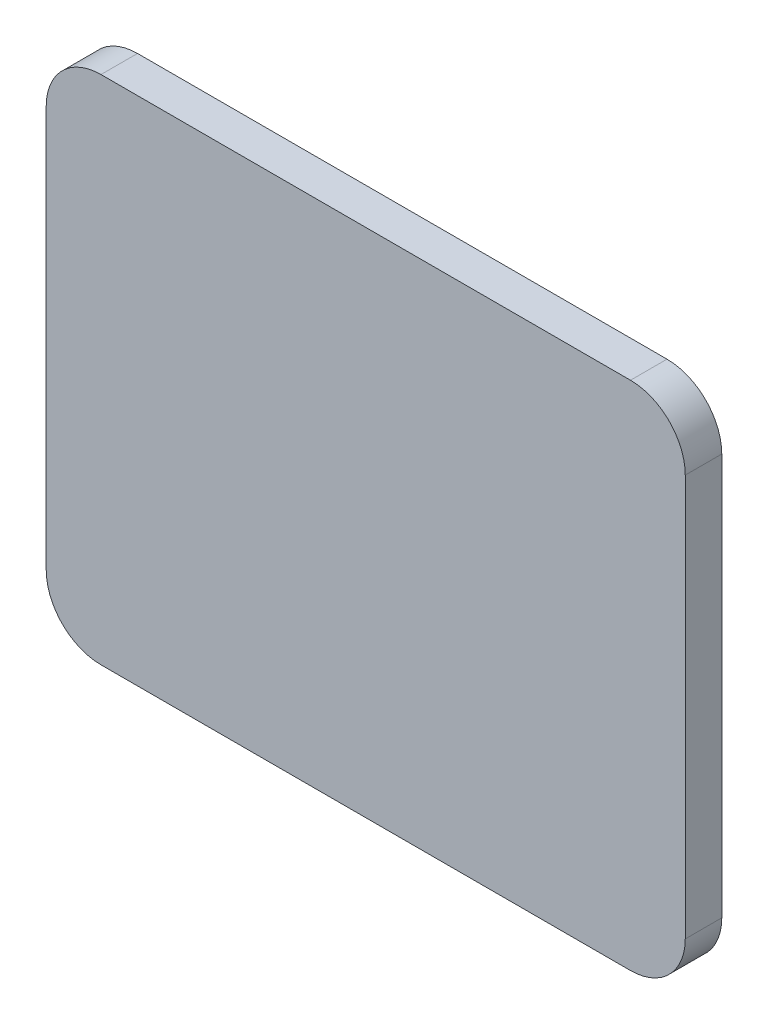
from build123d import *

# Parameters (mm, degrees)
EXTRUDE_1_DEPTH = 0.2


with BuildPart() as part:
    # Sketch 1 → Extrude 1 (new body)
    with BuildSketch(Plane.XY):
        with BuildLine():
            Line((-80.918479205, 58.379598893), (-78.018479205, 58.379598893))
            ThreePointArc((-78.018479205, 58.379598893), (-77.806347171, 58.291730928), (-77.718479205, 58.079598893))
            Line((-77.718479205, 58.079598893), (-77.718479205, 55.879598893))
            ThreePointArc((-77.718479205, 55.879598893), (-77.806347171, 55.667466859), (-78.018479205, 55.579598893))
            Line((-78.018479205, 55.579598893), (-80.918479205, 55.579598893))
            ThreePointArc((-80.918479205, 55.579598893), (-81.130611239, 55.667466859), (-81.218479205, 55.879598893))
            Line((-81.218479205, 55.879598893), (-81.218479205, 58.079598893))
            ThreePointArc((-81.218479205, 58.079598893), (-81.130611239, 58.291730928), (-80.918479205, 58.379598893))
        make_face()
    extrude(amount=EXTRUDE_1_DEPTH)


solid = part.part
